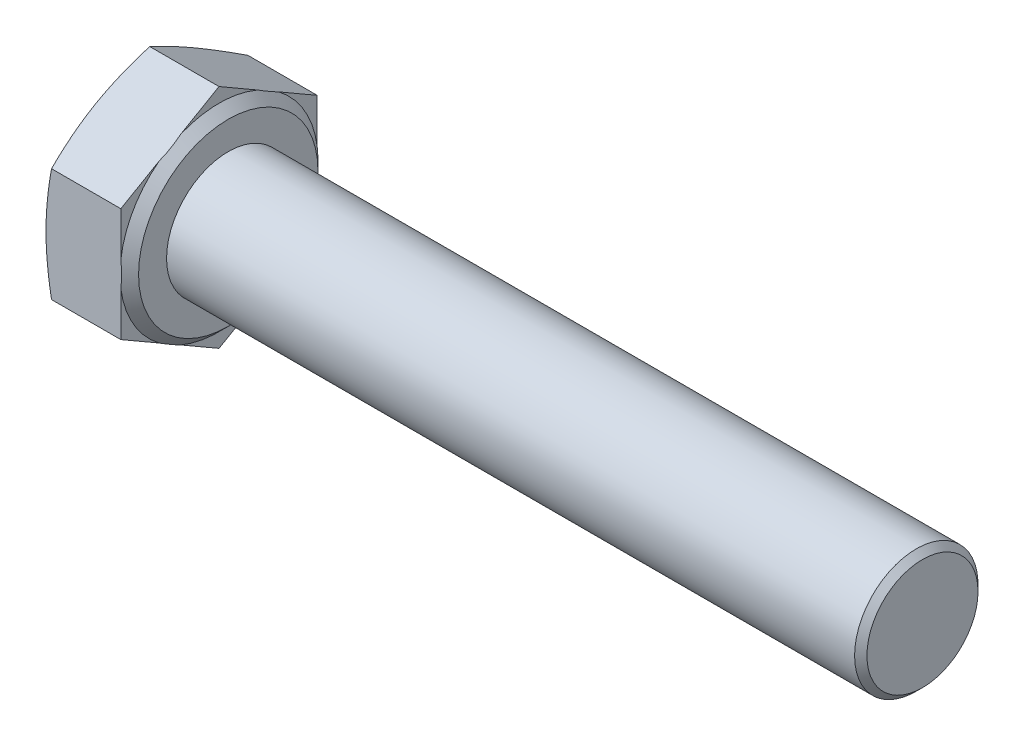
from build123d import *

# Parameters (mm, degrees)
BASEHEAD_DEPTH = 5.45
SKETCH5_R      = 4
BASEBODY_DEPTH = 45
CHAMFER1_SIZE  = 0.4


with BuildPart() as part:
    # Sketch2 → BaseHead (new body)
    with BuildSketch(Plane(origin=(0, 0, 0), x_dir=(0, 0, -1), z_dir=(1, 0, 0))):
        Polygon((6.365, -3.674834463), (6.365, 3.674834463), (0, 7.349668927), (-6.365, 3.674834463), (-6.365, -3.674834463), (0, -7.349668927), align=None)
    extrude(amount=BASEHEAD_DEPTH)

    # Sketch3 → BearingFace (revolve, cut)
    with BuildSketch(Plane.XY, mode=Mode.PRIVATE) as bearingface_sk:
        Polygon((5.45, 7.349668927), (5.45, 5.815), (4.85, 6.415), (4.85, 7.349668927), align=None)
    revolve(bearingface_sk.sketch.rotate(Axis((-0.957090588, 0, 0), (1, 0, 0)), 90), axis=Axis((-0.957090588, 0, 0), (1, 0, 0)), mode=Mode.SUBTRACT)

    # Sketch4 → HeadChamfer (revolve, cut)
    with BuildSketch(Plane.XY):
        Polygon((0, 7.349668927), (0.35839018, 7.349668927), (0, 6.365), align=None)
    revolve(axis=Axis((-0.493528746, 0, 0), (1, 0, 0)), mode=Mode.SUBTRACT)

    # Sketch5 → BaseBody (add)
    with BuildSketch(Plane(origin=(5.45, 0, 0), x_dir=(0, 0, -1), z_dir=(1, 0, 0))):
        with Locations(Location((0, 0, 0), (0, 0, 180))):
            Circle(SKETCH5_R)
    extrude(amount=BASEBODY_DEPTH)

    # Chamfer1
    chamfer1_edges = [part.edges().sort_by_distance(p)[0] for p in [
        (50.45, 0, -4),
    ]]
    chamfer(chamfer1_edges, length=CHAMFER1_SIZE)


solid = part.part
